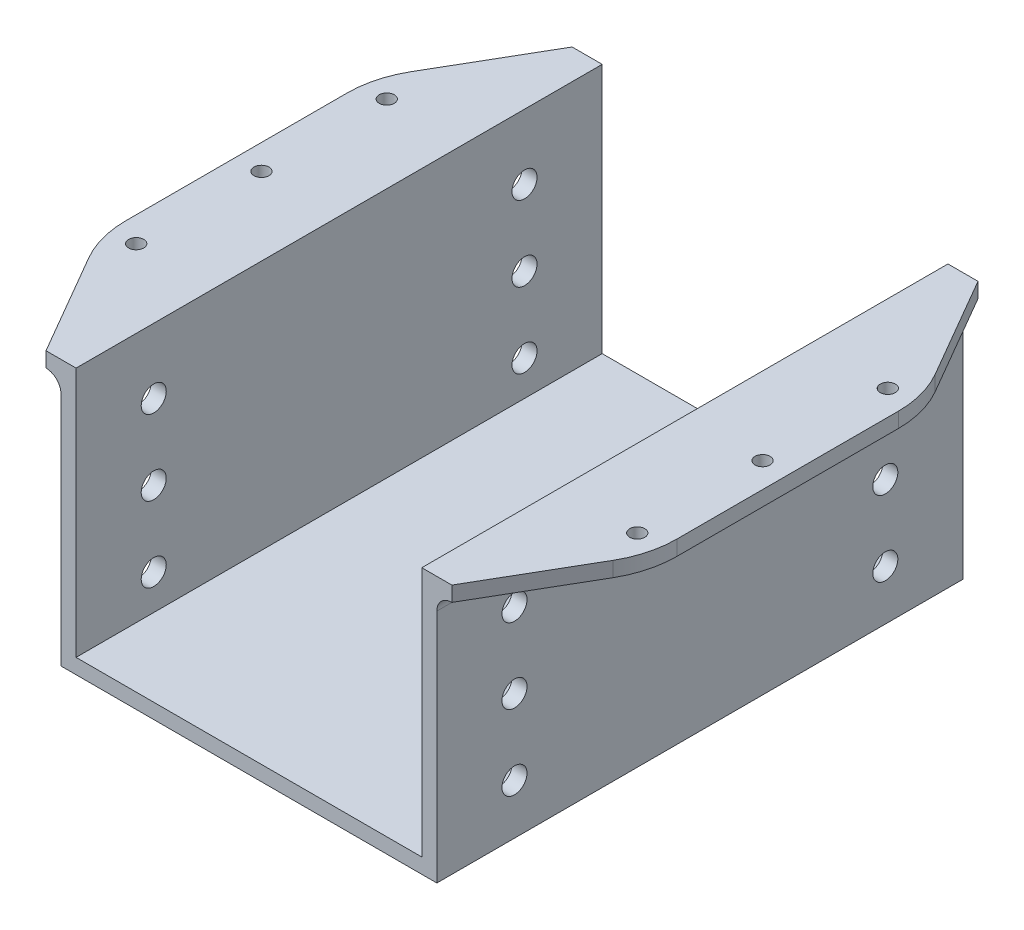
from build123d import *

# Parameters (mm, degrees)
EXTRUDE_1_DEPTH            = 105
SKETCH_5_R                 = 1.5
CUT_EXTRUDE_3_DEPTH        = 3
FILLET_9_R                 = 20
SKETCH_8_W                 = 105
SKETCH_8_H                 = 50
EXTRUDE_3_DEPTH            = 2
SKETCH_9_W                 = 105
SKETCH_9_H                 = 50
CUT_EXTRUDE_5_DEPTH        = 2
SKETCH_10_W                = 105
SKETCH_10_H                = 50
EXTRUDE_4_DEPTH            = 2
SKETCH_11_W                = 105
SKETCH_11_H                = 50
CUT_EXTRUDE_6_DEPTH        = 2
FILLET_12_R                = 3
SKETCH_12_R                = 2.5
CUT_EXTRUDE_7_DEPTH        = 143.420153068
PATTERN_LINEAR_1_COUNT     = 2
PATTERN_LINEAR_1_PITCH     = 15
PATTERN_LINEAR_1_COL_COUNT = 2
PATTERN_LINEAR_1_COL_PITCH = 15


with BuildPart() as part:
    # Sketch 1 → Extrude 1 (new body)
    with BuildSketch(Plane.XY):
        Polygon((-32.5, 23.5), (-32.5, -23.5), (32.5, -23.5), (32.5, 23.5), (32.5, 26.5), (35.5, 26.5), (55, 26.5), (55, 23.5), (35.5, 23.5), (35.5, -26.5), (-35.5, -26.5), (-35.5, 23.5), (-55, 23.5), (-55, 26.5), (-32.5, 26.5), align=None)
    extrude(amount=EXTRUDE_1_DEPTH)

    # Sketch 5 → Cut-Extrude 3 (cut)
    with BuildSketch(Plane(origin=(0, 26.5, 0), x_dir=(1, 0, 0), z_dir=(0, 1, 0))):
        with Locations(Location((-50, -52.5, 0), (0, 0, 270))):
            Circle(SKETCH_5_R)
        with Locations(Location((-50, -27.5, 0), (0, 0, 270))):
            Circle(SKETCH_5_R)
        with Locations(Location((-50, -77.5, 0), (0, 0, 270))):
            Circle(SKETCH_5_R)
        with Locations(Location((50, -77.5, 0), (0, 0, 90))):
            Circle(SKETCH_5_R)
        with Locations(Location((50, -52.5, 0), (0, 0, 90))):
            Circle(SKETCH_5_R)
        with Locations(Location((50, -27.5, 0), (0, 0, 90))):
            Circle(SKETCH_5_R)
        Polygon((-40.5, -105), (-55, -105), (-55, -80), align=None)
        Polygon((55, -105), (55, -80), (40.5, -105), align=None)
        Polygon((40.5, 0), (55, 0), (55, -25), align=None)
        Polygon((-55, 0), (-55, -25), (-40.5, 0), align=None)
    extrude(amount=-CUT_EXTRUDE_3_DEPTH, mode=Mode.SUBTRACT)

    # Fillet 9
    fillet_9_edges = [part.edges().sort_by_distance(p)[0] for p in [
        (-55, 25, 80),
        (55, 25, 80),
        (55, 25, 25),
        (-55, 25, 25),
    ]]
    fillet(fillet_9_edges, radius=FILLET_9_R)

    # Sketch 8 → Extrude 3 (add)
    with BuildSketch(Plane.ZY.offset(35.5)):
        with Locations((52.5, -1.5)):
            Rectangle(SKETCH_8_W, SKETCH_8_H)
    extrude(amount=EXTRUDE_3_DEPTH)

    # Sketch 9 → Cut-Extrude 5 (cut)
    with BuildSketch(Plane(origin=(-32.5, 0, 0), x_dir=(0, 0, -1), z_dir=(1, 0, 0))):
        with Locations((-52.5, 1.5)):
            Rectangle(SKETCH_9_W, SKETCH_9_H)
    extrude(amount=-CUT_EXTRUDE_5_DEPTH, mode=Mode.SUBTRACT)

    # Sketch 10 → Extrude 4 (add)
    with BuildSketch(Plane(origin=(35.5, 0, 0), x_dir=(0, 0, -1), z_dir=(1, 0, 0))):
        with Locations((-52.5, -1.5)):
            Rectangle(SKETCH_10_W, SKETCH_10_H)
    extrude(amount=EXTRUDE_4_DEPTH)

    # Sketch 11 → Cut-Extrude 6 (cut)
    with BuildSketch(Plane.ZY.offset(-32.5)):
        with Locations((52.5, 1.5)):
            Rectangle(SKETCH_11_W, SKETCH_11_H)
    extrude(amount=-CUT_EXTRUDE_6_DEPTH, mode=Mode.SUBTRACT)

    # Fillet 12
    fillet_12_edges = [part.edges().sort_by_distance(p)[0] for p in [
        (-37.5, 23.5, 52.5),
        (37.5, 23.5, 52.5),
    ]]
    fillet(fillet_12_edges, radius=FILLET_12_R)

    # Sketch 12 → Cut-Extrude 7 (cut, through all)
    with BuildSketch(Plane.ZY.offset(37.5)):
        with Locations((89.5, -1.5)):
            Circle(SKETCH_12_R)
        with Locations((15.5, -1.5)):
            Circle(SKETCH_12_R)
    cut_extrude_7 = extrude(amount=-CUT_EXTRUDE_7_DEPTH, mode=Mode.SUBTRACT)

    # Pattern Linear 1: Cut-Extrude 7 ×2
    with Locations(*[(0, -i * PATTERN_LINEAR_1_PITCH, 0) for i in range(1, PATTERN_LINEAR_1_COUNT)]):
        add(cut_extrude_7, mode=Mode.SUBTRACT)

    # Pattern Linear 1 col: Cut-Extrude 7 ×2
    with Locations(*[(0, i * PATTERN_LINEAR_1_COL_PITCH, 0) for i in range(1, PATTERN_LINEAR_1_COL_COUNT)]):
        add(cut_extrude_7, mode=Mode.SUBTRACT)


solid = part.part
